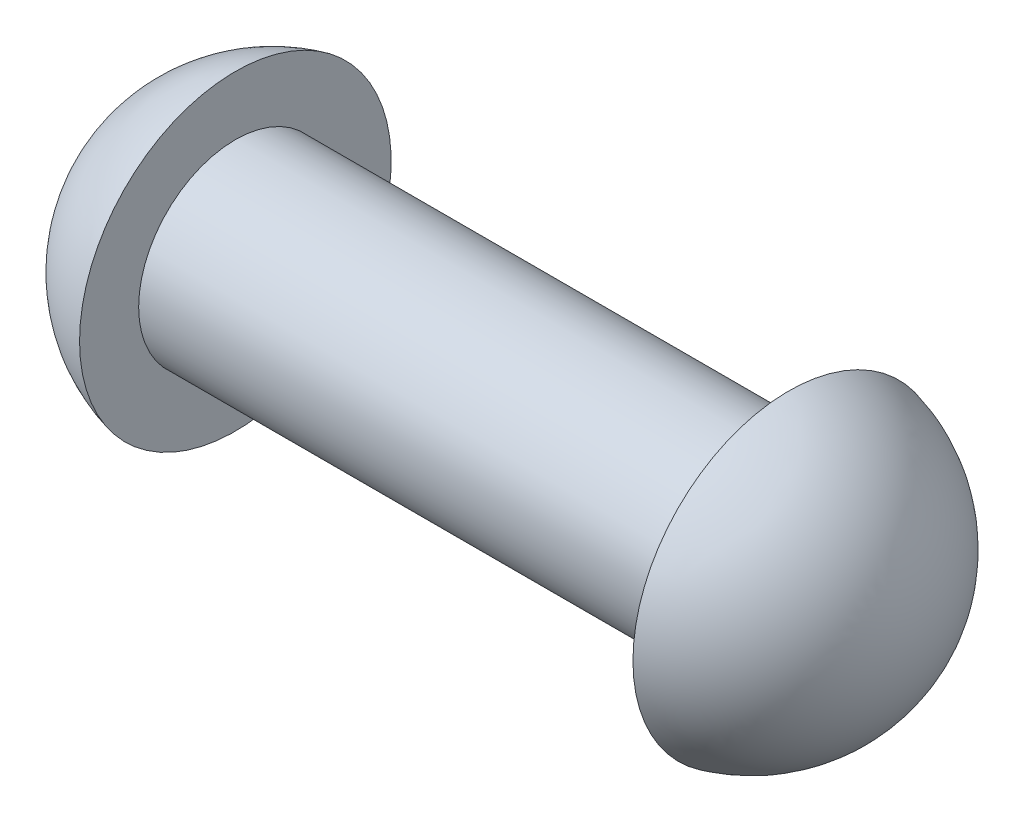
from build123d import *


with BuildPart() as part:
    # Sketch1 → Base-Revolve (revolve)
    with BuildSketch(Plane.XY, mode=Mode.PRIVATE) as base_revolve_sk:
        with BuildLine():
            Line((-126, 0), (0, 0))
            Line((0, 0), (0, 18))
            Line((0, 18), (-103, 18))
            Line((-103, 18), (-103, 29))
            ThreePointArc((-103, 29), (-119.505423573, 18.469818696), (-126, 0))
        make_face()
    revolve(base_revolve_sk.sketch.rotate(Axis((-138, 0, 0), (1, 0, 0)), 90), axis=Axis((-138, 0, 0), (1, 0, 0)))

    # Sketch2 → HeadTypeA (revolve)
    with BuildSketch(Plane.XY):
        with BuildLine():
            Line((0, 0), (23, 0))
            ThreePointArc((23, 0), (16.505423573, 18.469818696), (0, 29))
            Line((0, 29), (0, 0))
        make_face()
    revolve(axis=Axis((-49, 0, 0), (1, 0, 0)))


solid = part.part
